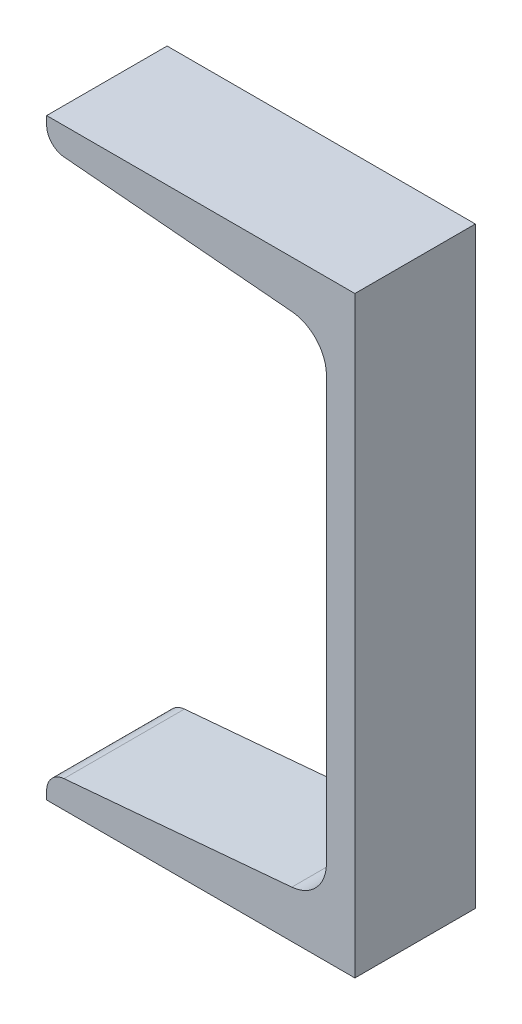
ISO-10303-21;
HEADER;
FILE_DESCRIPTION(('STEP AP214'),'2;1');
FILE_NAME('part.step','',(''),(''),'','','');
FILE_SCHEMA(('AUTOMOTIVE_DESIGN { 1 0 10303 214 1 1 1 1 }'));
ENDSEC;
DATA;
#1=APPLICATION_CONTEXT('core data for automotive mechanical design processes');
#2=APPLICATION_PROTOCOL_DEFINITION('international standard','automotive_design',2000,#1);
#3=PRODUCT_CONTEXT('',#1,'mechanical');
#4=PRODUCT('Part','Part','',(#3));
#5=PRODUCT_RELATED_PRODUCT_CATEGORY('part','',(#4));
#6=PRODUCT_DEFINITION_FORMATION('','',#4);
#7=PRODUCT_DEFINITION_CONTEXT('part definition',#1,'design');
#8=PRODUCT_DEFINITION('design','',#6,#7);
#9=PRODUCT_DEFINITION_SHAPE('','',#8);
#10=(LENGTH_UNIT() NAMED_UNIT(*) SI_UNIT(.MILLI.,.METRE.));
#11=(NAMED_UNIT(*) PLANE_ANGLE_UNIT() SI_UNIT($,.RADIAN.));
#12=(NAMED_UNIT(*) SI_UNIT($,.STERADIAN.) SOLID_ANGLE_UNIT());
#13=UNCERTAINTY_MEASURE_WITH_UNIT(LENGTH_MEASURE(1.E-05),#10,'distance_accuracy_value','');
#14=(GEOMETRIC_REPRESENTATION_CONTEXT(3) GLOBAL_UNCERTAINTY_ASSIGNED_CONTEXT((#13)) GLOBAL_UNIT_ASSIGNED_CONTEXT((#10,
#11,#12)) REPRESENTATION_CONTEXT('',''));
#15=CARTESIAN_POINT('',(0.,0.,0.));
#16=DIRECTION('',(0.,0.,1.));
#17=DIRECTION('',(1.,0.,0.));
#18=AXIS2_PLACEMENT_3D('',#15,#16,#17);
#19=CARTESIAN_POINT('',(-65.,62.5,12.7));
#20=DIRECTION('',(1.,0.,0.));
#21=DIRECTION('',(0.,1.,0.));
#22=AXIS2_PLACEMENT_3D('',#19,#20,#21);
#23=PLANE('',#22);
#24=DIRECTION('',(0.,-1.,0.));
#25=VECTOR('',#24,1.);
#26=CARTESIAN_POINT('',(-65.,62.5,-12.7));
#27=LINE('',#26,#25);
#28=CARTESIAN_POINT('',(-65.,62.5,-12.7));
#29=VERTEX_POINT('',#28);
#30=CARTESIAN_POINT('',(-65.,60.7462402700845,-12.7));
#31=VERTEX_POINT('',#30);
#32=EDGE_CURVE('E160',#29,#31,#27,.T.);
#33=ORIENTED_EDGE('',*,*,#32,.T.);
#34=DIRECTION('',(0.,0.,-1.));
#35=VECTOR('',#34,1.);
#36=CARTESIAN_POINT('',(-65.,60.7462402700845,12.7));
#37=LINE('',#36,#35);
#38=CARTESIAN_POINT('',(-65.,60.7462402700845,12.7));
#39=VERTEX_POINT('',#38);
#40=EDGE_CURVE('E11',#39,#31,#37,.T.);
#41=ORIENTED_EDGE('',*,*,#40,.F.);
#42=DIRECTION('',(0.,-1.,0.));
#43=VECTOR('',#42,1.);
#44=CARTESIAN_POINT('',(-65.,62.5,12.7));
#45=LINE('',#44,#43);
#46=CARTESIAN_POINT('',(-65.,62.5,12.7));
#47=VERTEX_POINT('',#46);
#48=EDGE_CURVE('E181',#47,#39,#45,.T.);
#49=ORIENTED_EDGE('',*,*,#48,.F.);
#50=DIRECTION('',(0.,0.,-1.));
#51=VECTOR('',#50,1.);
#52=CARTESIAN_POINT('',(-65.,62.5,12.7));
#53=LINE('',#52,#51);
#54=EDGE_CURVE('E153',#47,#29,#53,.T.);
#55=ORIENTED_EDGE('',*,*,#54,.T.);
#56=EDGE_LOOP('',(#33,#41,#49,#55));
#57=FACE_BOUND('',#56,.T.);
#58=ADVANCED_FACE('F39',(#57),#23,.F.);
#59=CARTESIAN_POINT('',(-61.,60.7462402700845,12.7));
#60=DIRECTION('',(0.,0.,-1.));
#61=DIRECTION('',(-1.,0.,0.));
#62=AXIS2_PLACEMENT_3D('',#59,#60,#61);
#63=CYLINDRICAL_SURFACE('',#62,3.99999999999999);
#64=CARTESIAN_POINT('',(-61.,60.7462402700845,-12.7));
#65=DIRECTION('',(0.,0.,1.));
#66=DIRECTION('',(1.,0.,0.));
#67=AXIS2_PLACEMENT_3D('',#64,#65,#66);
#68=CIRCLE('',#67,3.99999999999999);
#69=CARTESIAN_POINT('',(-61.3486229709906,56.7614614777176,-12.7));
#70=VERTEX_POINT('',#69);
#71=EDGE_CURVE('E162',#31,#70,#68,.T.);
#72=ORIENTED_EDGE('',*,*,#71,.T.);
#73=DIRECTION('',(0.,0.,-1.));
#74=VECTOR('',#73,1.);
#75=CARTESIAN_POINT('',(-61.3486229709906,56.7614614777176,12.7));
#76=LINE('',#75,#74);
#77=CARTESIAN_POINT('',(-61.3486229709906,56.7614614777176,12.7));
#78=VERTEX_POINT('',#77);
#79=EDGE_CURVE('E50',#78,#70,#76,.T.);
#80=ORIENTED_EDGE('',*,*,#79,.F.);
#81=CARTESIAN_POINT('',(-61.,60.7462402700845,12.7));
#82=DIRECTION('',(0.,0.,1.));
#83=DIRECTION('',(1.,0.,0.));
#84=AXIS2_PLACEMENT_3D('',#81,#82,#83);
#85=CIRCLE('',#84,3.99999999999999);
#86=EDGE_CURVE('E109',#39,#78,#85,.T.);
#87=ORIENTED_EDGE('',*,*,#86,.F.);
#88=ORIENTED_EDGE('',*,*,#40,.T.);
#89=EDGE_LOOP('',(#72,#80,#87,#88));
#90=FACE_BOUND('',#89,.T.);
#91=ADVANCED_FACE('F256',(#90),#63,.T.);
#92=CARTESIAN_POINT('',(-61.3486229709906,56.7614614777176,12.7));
#93=DIRECTION('',(0.087155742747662,0.996194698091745,0.));
#94=DIRECTION('',(-0.996194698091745,0.087155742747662,0.));
#95=AXIS2_PLACEMENT_3D('',#92,#93,#94);
#96=PLANE('',#95);
#97=DIRECTION('',(0.996194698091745,-0.087155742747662,0.));
#98=VECTOR('',#97,1.);
#99=CARTESIAN_POINT('',(-61.3486229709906,56.7614614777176,-12.7));
#100=LINE('',#99,#98);
#101=CARTESIAN_POINT('',(-13.3027540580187,52.5579926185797,-12.7));
#102=VERTEX_POINT('',#101);
#103=EDGE_CURVE('E165',#70,#102,#100,.T.);
#104=ORIENTED_EDGE('',*,*,#103,.T.);
#105=DIRECTION('',(0.,0.,-1.));
#106=VECTOR('',#105,1.);
#107=CARTESIAN_POINT('',(-13.3027540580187,52.5579926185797,12.7));
#108=LINE('',#107,#106);
#109=CARTESIAN_POINT('',(-13.3027540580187,52.5579926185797,12.7));
#110=VERTEX_POINT('',#109);
#111=EDGE_CURVE('E198',#110,#102,#108,.T.);
#112=ORIENTED_EDGE('',*,*,#111,.F.);
#113=DIRECTION('',(0.996194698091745,-0.087155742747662,0.));
#114=VECTOR('',#113,1.);
#115=CARTESIAN_POINT('',(-61.3486229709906,56.7614614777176,12.7));
#116=LINE('',#115,#114);
#117=EDGE_CURVE('E206',#78,#110,#116,.T.);
#118=ORIENTED_EDGE('',*,*,#117,.F.);
#119=ORIENTED_EDGE('',*,*,#79,.T.);
#120=EDGE_LOOP('',(#104,#112,#118,#119));
#121=FACE_BOUND('',#120,.T.);
#122=ADVANCED_FACE('F207',(#121),#96,.F.);
#123=CARTESIAN_POINT('',(-14.,44.5884350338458,12.7));
#124=DIRECTION('',(0.,0.,-1.));
#125=DIRECTION('',(-1.,0.,0.));
#126=AXIS2_PLACEMENT_3D('',#123,#124,#125);
#127=CYLINDRICAL_SURFACE('',#126,7.99999999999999);
#128=CARTESIAN_POINT('',(-14.,44.5884350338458,-12.7));
#129=DIRECTION('',(0.,0.,-1.));
#130=DIRECTION('',(-1.,0.,0.));
#131=AXIS2_PLACEMENT_3D('',#128,#129,#130);
#132=CIRCLE('',#131,7.99999999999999);
#133=CARTESIAN_POINT('',(-5.99999999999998,44.5884350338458,-12.7));
#134=VERTEX_POINT('',#133);
#135=EDGE_CURVE('E168',#102,#134,#132,.T.);
#136=ORIENTED_EDGE('',*,*,#135,.T.);
#137=DIRECTION('',(0.,0.,-1.));
#138=VECTOR('',#137,1.);
#139=CARTESIAN_POINT('',(-5.99999999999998,44.5884350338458,12.7));
#140=LINE('',#139,#138);
#141=CARTESIAN_POINT('',(-5.99999999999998,44.5884350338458,12.7));
#142=VERTEX_POINT('',#141);
#143=EDGE_CURVE('E199',#142,#134,#140,.T.);
#144=ORIENTED_EDGE('',*,*,#143,.F.);
#145=CARTESIAN_POINT('',(-14.,44.5884350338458,12.7));
#146=DIRECTION('',(0.,0.,-1.));
#147=DIRECTION('',(-1.,0.,0.));
#148=AXIS2_PLACEMENT_3D('',#145,#146,#147);
#149=CIRCLE('',#148,7.99999999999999);
#150=EDGE_CURVE('E228',#110,#142,#149,.T.);
#151=ORIENTED_EDGE('',*,*,#150,.F.);
#152=ORIENTED_EDGE('',*,*,#111,.T.);
#153=EDGE_LOOP('',(#136,#144,#151,#152));
#154=FACE_BOUND('',#153,.T.);
#155=ADVANCED_FACE('F219',(#154),#127,.F.);
#156=CARTESIAN_POINT('',(-5.99999999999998,44.5884350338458,12.7));
#157=DIRECTION('',(1.,0.,0.));
#158=DIRECTION('',(0.,0.,-1.));
#159=AXIS2_PLACEMENT_3D('',#156,#157,#158);
#160=PLANE('',#159);
#161=DIRECTION('',(0.,-1.,0.));
#162=VECTOR('',#161,1.);
#163=CARTESIAN_POINT('',(-5.99999999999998,44.5884350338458,-12.7));
#164=LINE('',#163,#162);
#165=CARTESIAN_POINT('',(-5.99999999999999,-44.5884350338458,-12.7));
#166=VERTEX_POINT('',#165);
#167=EDGE_CURVE('E166',#134,#166,#164,.T.);
#168=ORIENTED_EDGE('',*,*,#167,.T.);
#169=DIRECTION('',(0.,0.,-1.));
#170=VECTOR('',#169,1.);
#171=CARTESIAN_POINT('',(-5.99999999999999,-44.5884350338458,12.7));
#172=LINE('',#171,#170);
#173=CARTESIAN_POINT('',(-5.99999999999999,-44.5884350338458,12.7));
#174=VERTEX_POINT('',#173);
#175=EDGE_CURVE('E191',#174,#166,#172,.T.);
#176=ORIENTED_EDGE('',*,*,#175,.F.);
#177=DIRECTION('',(0.,-1.,0.));
#178=VECTOR('',#177,1.);
#179=CARTESIAN_POINT('',(-5.99999999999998,44.5884350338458,12.7));
#180=LINE('',#179,#178);
#181=EDGE_CURVE('E222',#142,#174,#180,.T.);
#182=ORIENTED_EDGE('',*,*,#181,.F.);
#183=ORIENTED_EDGE('',*,*,#143,.T.);
#184=EDGE_LOOP('',(#168,#176,#182,#183));
#185=FACE_BOUND('',#184,.T.);
#186=ADVANCED_FACE('F223',(#185),#160,.F.);
#187=CARTESIAN_POINT('',(-14.,-44.5884350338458,12.7));
#188=DIRECTION('',(0.,0.,-1.));
#189=DIRECTION('',(-1.,0.,0.));
#190=AXIS2_PLACEMENT_3D('',#187,#188,#189);
#191=CYLINDRICAL_SURFACE('',#190,7.99999999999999);
#192=CARTESIAN_POINT('',(-14.,-44.5884350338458,-12.7));
#193=DIRECTION('',(0.,0.,-1.));
#194=DIRECTION('',(1.,0.,0.));
#195=AXIS2_PLACEMENT_3D('',#192,#193,#194);
#196=CIRCLE('',#195,7.99999999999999);
#197=CARTESIAN_POINT('',(-13.3027540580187,-52.5579926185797,-12.7));
#198=VERTEX_POINT('',#197);
#199=EDGE_CURVE('E167',#166,#198,#196,.T.);
#200=ORIENTED_EDGE('',*,*,#199,.T.);
#201=DIRECTION('',(0.,0.,-1.));
#202=VECTOR('',#201,1.);
#203=CARTESIAN_POINT('',(-13.3027540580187,-52.5579926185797,12.7));
#204=LINE('',#203,#202);
#205=CARTESIAN_POINT('',(-13.3027540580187,-52.5579926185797,12.7));
#206=VERTEX_POINT('',#205);
#207=EDGE_CURVE('E192',#206,#198,#204,.T.);
#208=ORIENTED_EDGE('',*,*,#207,.F.);
#209=CARTESIAN_POINT('',(-14.,-44.5884350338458,12.7));
#210=DIRECTION('',(0.,0.,-1.));
#211=DIRECTION('',(1.,0.,0.));
#212=AXIS2_PLACEMENT_3D('',#209,#210,#211);
#213=CIRCLE('',#212,7.99999999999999);
#214=EDGE_CURVE('E221',#174,#206,#213,.T.);
#215=ORIENTED_EDGE('',*,*,#214,.F.);
#216=ORIENTED_EDGE('',*,*,#175,.T.);
#217=EDGE_LOOP('',(#200,#208,#215,#216));
#218=FACE_BOUND('',#217,.T.);
#219=ADVANCED_FACE('F275',(#218),#191,.F.);
#220=CARTESIAN_POINT('',(-61.3486229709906,-56.7614614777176,12.7));
#221=DIRECTION('',(0.087155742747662,-0.996194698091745,0.));
#222=DIRECTION('',(0.996194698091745,0.087155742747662,0.));
#223=AXIS2_PLACEMENT_3D('',#220,#221,#222);
#224=PLANE('',#223);
#225=DIRECTION('',(-0.996194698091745,-0.087155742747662,0.));
#226=VECTOR('',#225,1.);
#227=CARTESIAN_POINT('',(-61.3486229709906,-56.7614614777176,-12.7));
#228=LINE('',#227,#226);
#229=CARTESIAN_POINT('',(-61.3486229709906,-56.7614614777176,-12.7));
#230=VERTEX_POINT('',#229);
#231=EDGE_CURVE('E175',#198,#230,#228,.T.);
#232=ORIENTED_EDGE('',*,*,#231,.T.);
#233=DIRECTION('',(0.,0.,-1.));
#234=VECTOR('',#233,1.);
#235=CARTESIAN_POINT('',(-61.3486229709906,-56.7614614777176,12.7));
#236=LINE('',#235,#234);
#237=CARTESIAN_POINT('',(-61.3486229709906,-56.7614614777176,12.7));
#238=VERTEX_POINT('',#237);
#239=EDGE_CURVE('E189',#238,#230,#236,.T.);
#240=ORIENTED_EDGE('',*,*,#239,.F.);
#241=DIRECTION('',(-0.996194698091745,-0.087155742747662,0.));
#242=VECTOR('',#241,1.);
#243=CARTESIAN_POINT('',(-61.3486229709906,-56.7614614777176,12.7));
#244=LINE('',#243,#242);
#245=EDGE_CURVE('E226',#206,#238,#244,.T.);
#246=ORIENTED_EDGE('',*,*,#245,.F.);
#247=ORIENTED_EDGE('',*,*,#207,.T.);
#248=EDGE_LOOP('',(#232,#240,#246,#247));
#249=FACE_BOUND('',#248,.T.);
#250=ADVANCED_FACE('F273',(#249),#224,.F.);
#251=CARTESIAN_POINT('',(-61.,-60.7462402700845,12.7));
#252=DIRECTION('',(0.,0.,-1.));
#253=DIRECTION('',(-1.,0.,0.));
#254=AXIS2_PLACEMENT_3D('',#251,#252,#253);
#255=CYLINDRICAL_SURFACE('',#254,3.99999999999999);
#256=CARTESIAN_POINT('',(-61.,-60.7462402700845,-12.7));
#257=DIRECTION('',(0.,0.,1.));
#258=DIRECTION('',(-1.,0.,0.));
#259=AXIS2_PLACEMENT_3D('',#256,#257,#258);
#260=CIRCLE('',#259,3.99999999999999);
#261=CARTESIAN_POINT('',(-65.,-60.7462402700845,-12.7));
#262=VERTEX_POINT('',#261);
#263=EDGE_CURVE('E172',#230,#262,#260,.T.);
#264=ORIENTED_EDGE('',*,*,#263,.T.);
#265=DIRECTION('',(0.,0.,-1.));
#266=VECTOR('',#265,1.);
#267=CARTESIAN_POINT('',(-65.,-60.7462402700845,12.7));
#268=LINE('',#267,#266);
#269=CARTESIAN_POINT('',(-65.,-60.7462402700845,12.7));
#270=VERTEX_POINT('',#269);
#271=EDGE_CURVE('E184',#270,#262,#268,.T.);
#272=ORIENTED_EDGE('',*,*,#271,.F.);
#273=CARTESIAN_POINT('',(-61.,-60.7462402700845,12.7));
#274=DIRECTION('',(0.,0.,1.));
#275=DIRECTION('',(-1.,0.,0.));
#276=AXIS2_PLACEMENT_3D('',#273,#274,#275);
#277=CIRCLE('',#276,3.99999999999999);
#278=EDGE_CURVE('E234',#238,#270,#277,.T.);
#279=ORIENTED_EDGE('',*,*,#278,.F.);
#280=ORIENTED_EDGE('',*,*,#239,.T.);
#281=EDGE_LOOP('',(#264,#272,#279,#280));
#282=FACE_BOUND('',#281,.T.);
#283=ADVANCED_FACE('F239',(#282),#255,.T.);
#284=CARTESIAN_POINT('',(-65.,-60.7462402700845,12.7));
#285=DIRECTION('',(1.,0.,0.));
#286=DIRECTION('',(0.,1.,0.));
#287=AXIS2_PLACEMENT_3D('',#284,#285,#286);
#288=PLANE('',#287);
#289=DIRECTION('',(0.,-1.,0.));
#290=VECTOR('',#289,1.);
#291=CARTESIAN_POINT('',(-65.,-60.7462402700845,-12.7));
#292=LINE('',#291,#290);
#293=CARTESIAN_POINT('',(-65.,-62.5,-12.7));
#294=VERTEX_POINT('',#293);
#295=EDGE_CURVE('E176',#262,#294,#292,.T.);
#296=ORIENTED_EDGE('',*,*,#295,.T.);
#297=DIRECTION('',(0.,0.,-1.));
#298=VECTOR('',#297,1.);
#299=CARTESIAN_POINT('',(-65.,-62.5,12.7));
#300=LINE('',#299,#298);
#301=CARTESIAN_POINT('',(-65.,-62.5,12.7));
#302=VERTEX_POINT('',#301);
#303=EDGE_CURVE('E148',#302,#294,#300,.T.);
#304=ORIENTED_EDGE('',*,*,#303,.F.);
#305=DIRECTION('',(0.,-1.,0.));
#306=VECTOR('',#305,1.);
#307=CARTESIAN_POINT('',(-65.,-60.7462402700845,12.7));
#308=LINE('',#307,#306);
#309=EDGE_CURVE('E142',#270,#302,#308,.T.);
#310=ORIENTED_EDGE('',*,*,#309,.F.);
#311=ORIENTED_EDGE('',*,*,#271,.T.);
#312=EDGE_LOOP('',(#296,#304,#310,#311));
#313=FACE_BOUND('',#312,.T.);
#314=ADVANCED_FACE('F242',(#313),#288,.F.);
#315=CARTESIAN_POINT('',(-65.,-62.5,12.7));
#316=DIRECTION('',(0.,1.,0.));
#317=DIRECTION('',(0.,0.,1.));
#318=AXIS2_PLACEMENT_3D('',#315,#316,#317);
#319=PLANE('',#318);
#320=DIRECTION('',(1.,0.,0.));
#321=VECTOR('',#320,1.);
#322=CARTESIAN_POINT('',(-65.,-62.5,-12.7));
#323=LINE('',#322,#321);
#324=CARTESIAN_POINT('',(0.,-62.5,-12.7));
#325=VERTEX_POINT('',#324);
#326=EDGE_CURVE('E146',#294,#325,#323,.T.);
#327=ORIENTED_EDGE('',*,*,#326,.T.);
#328=DIRECTION('',(0.,0.,-1.));
#329=VECTOR('',#328,1.);
#330=CARTESIAN_POINT('',(0.,-62.5,12.7));
#331=LINE('',#330,#329);
#332=CARTESIAN_POINT('',(0.,-62.5,12.7));
#333=VERTEX_POINT('',#332);
#334=EDGE_CURVE('E147',#333,#325,#331,.T.);
#335=ORIENTED_EDGE('',*,*,#334,.F.);
#336=DIRECTION('',(1.,0.,0.));
#337=VECTOR('',#336,1.);
#338=CARTESIAN_POINT('',(-65.,-62.5,12.7));
#339=LINE('',#338,#337);
#340=EDGE_CURVE('E133',#302,#333,#339,.T.);
#341=ORIENTED_EDGE('',*,*,#340,.F.);
#342=ORIENTED_EDGE('',*,*,#303,.T.);
#343=EDGE_LOOP('',(#327,#335,#341,#342));
#344=FACE_BOUND('',#343,.T.);
#345=ADVANCED_FACE('F150',(#344),#319,.F.);
#346=CARTESIAN_POINT('',(0.,62.5,12.7));
#347=DIRECTION('',(-1.,0.,0.));
#348=DIRECTION('',(0.,0.,1.));
#349=AXIS2_PLACEMENT_3D('',#346,#347,#348);
#350=PLANE('',#349);
#351=DIRECTION('',(0.,1.,0.));
#352=VECTOR('',#351,1.);
#353=CARTESIAN_POINT('',(0.,62.5,-12.7));
#354=LINE('',#353,#352);
#355=CARTESIAN_POINT('',(0.,62.5,-12.7));
#356=VERTEX_POINT('',#355);
#357=EDGE_CURVE('E98',#325,#356,#354,.T.);
#358=ORIENTED_EDGE('',*,*,#357,.T.);
#359=DIRECTION('',(0.,0.,-1.));
#360=VECTOR('',#359,1.);
#361=CARTESIAN_POINT('',(0.,62.5,12.7));
#362=LINE('',#361,#360);
#363=CARTESIAN_POINT('',(0.,62.5,12.7));
#364=VERTEX_POINT('',#363);
#365=EDGE_CURVE('E152',#364,#356,#362,.T.);
#366=ORIENTED_EDGE('',*,*,#365,.F.);
#367=DIRECTION('',(0.,1.,0.));
#368=VECTOR('',#367,1.);
#369=CARTESIAN_POINT('',(0.,62.5,12.7));
#370=LINE('',#369,#368);
#371=EDGE_CURVE('E140',#333,#364,#370,.T.);
#372=ORIENTED_EDGE('',*,*,#371,.F.);
#373=ORIENTED_EDGE('',*,*,#334,.T.);
#374=EDGE_LOOP('',(#358,#366,#372,#373));
#375=FACE_BOUND('',#374,.T.);
#376=ADVANCED_FACE('F155',(#375),#350,.F.);
#377=CARTESIAN_POINT('',(-65.,62.5,12.7));
#378=DIRECTION('',(0.,-1.,0.));
#379=DIRECTION('',(0.,0.,-1.));
#380=AXIS2_PLACEMENT_3D('',#377,#378,#379);
#381=PLANE('',#380);
#382=DIRECTION('',(-1.,0.,0.));
#383=VECTOR('',#382,1.);
#384=CARTESIAN_POINT('',(-65.,62.5,-12.7));
#385=LINE('',#384,#383);
#386=EDGE_CURVE('E105',#356,#29,#385,.T.);
#387=ORIENTED_EDGE('',*,*,#386,.T.);
#388=ORIENTED_EDGE('',*,*,#54,.F.);
#389=DIRECTION('',(-1.,0.,0.));
#390=VECTOR('',#389,1.);
#391=CARTESIAN_POINT('',(-65.,62.5,12.7));
#392=LINE('',#391,#390);
#393=EDGE_CURVE('E54',#364,#47,#392,.T.);
#394=ORIENTED_EDGE('',*,*,#393,.F.);
#395=ORIENTED_EDGE('',*,*,#365,.T.);
#396=EDGE_LOOP('',(#387,#388,#394,#395));
#397=FACE_BOUND('',#396,.T.);
#398=ADVANCED_FACE('F247',(#397),#381,.F.);
#399=CARTESIAN_POINT('',(-61.,60.7462402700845,12.7));
#400=DIRECTION('',(0.,0.,1.));
#401=DIRECTION('',(1.,0.,0.));
#402=AXIS2_PLACEMENT_3D('',#399,#400,#401);
#403=PLANE('',#402);
#404=ORIENTED_EDGE('',*,*,#48,.T.);
#405=ORIENTED_EDGE('',*,*,#86,.T.);
#406=ORIENTED_EDGE('',*,*,#117,.T.);
#407=ORIENTED_EDGE('',*,*,#150,.T.);
#408=ORIENTED_EDGE('',*,*,#181,.T.);
#409=ORIENTED_EDGE('',*,*,#214,.T.);
#410=ORIENTED_EDGE('',*,*,#245,.T.);
#411=ORIENTED_EDGE('',*,*,#278,.T.);
#412=ORIENTED_EDGE('',*,*,#309,.T.);
#413=ORIENTED_EDGE('',*,*,#340,.T.);
#414=ORIENTED_EDGE('',*,*,#371,.T.);
#415=ORIENTED_EDGE('',*,*,#393,.T.);
#416=EDGE_LOOP('',(#404,#405,#406,#407,#408,#409,#410,#411,#412,#413,#414,#415));
#417=FACE_BOUND('',#416,.T.);
#418=ADVANCED_FACE('F139',(#417),#403,.T.);
#419=CARTESIAN_POINT('',(-61.,60.7462402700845,-12.7));
#420=DIRECTION('',(0.,0.,1.));
#421=DIRECTION('',(1.,0.,0.));
#422=AXIS2_PLACEMENT_3D('',#419,#420,#421);
#423=PLANE('',#422);
#424=ORIENTED_EDGE('',*,*,#32,.F.);
#425=ORIENTED_EDGE('',*,*,#386,.F.);
#426=ORIENTED_EDGE('',*,*,#357,.F.);
#427=ORIENTED_EDGE('',*,*,#326,.F.);
#428=ORIENTED_EDGE('',*,*,#295,.F.);
#429=ORIENTED_EDGE('',*,*,#263,.F.);
#430=ORIENTED_EDGE('',*,*,#231,.F.);
#431=ORIENTED_EDGE('',*,*,#199,.F.);
#432=ORIENTED_EDGE('',*,*,#167,.F.);
#433=ORIENTED_EDGE('',*,*,#135,.F.);
#434=ORIENTED_EDGE('',*,*,#103,.F.);
#435=ORIENTED_EDGE('',*,*,#71,.F.);
#436=EDGE_LOOP('',(#424,#425,#426,#427,#428,#429,#430,#431,#432,#433,#434,#435));
#437=FACE_BOUND('',#436,.T.);
#438=ADVANCED_FACE('F215',(#437),#423,.F.);
#439=CLOSED_SHELL('',(#58,#91,#122,#155,#186,#219,#250,#283,#314,#345,#376,#398,#418,#438));
#440=MANIFOLD_SOLID_BREP('B2',#439);
#441=ADVANCED_BREP_SHAPE_REPRESENTATION('',(#18,#440),#14);
#442=SHAPE_DEFINITION_REPRESENTATION(#9,#441);
ENDSEC;
END-ISO-10303-21;
